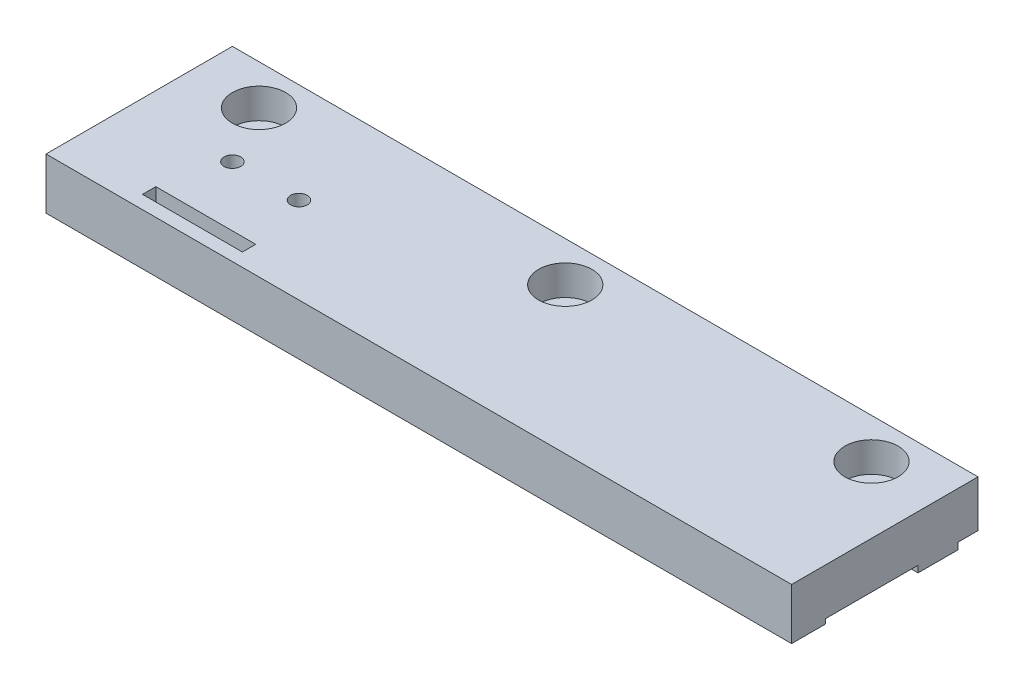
from build123d import *

# Parameters (mm, degrees)
SKETCH_1_W          = 112
SKETCH_1_H          = 8
EXTRUDE_1_DEPTH     = 28
SKETCH_2_OUTSIDE_W  = 53.144
SKETCH_2_OUTSIDE_H  = 33.144
CUT_EXTRUDE_1_DEPTH = 116.723809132
SKETCH_3_R          = 2.25
SKETCH_3_R_2        = 1.25
SKETCH_3_W          = 15
SKETCH_3_H          = 2
CUT_EXTRUDE_3_DEPTH = 28
SKETCH_4_R          = 4
CUT_EXTRUDE_4_DEPTH = 4.5


with BuildPart() as part:
    # Sketch 1 → Extrude 1 (new body)
    with BuildSketch(Plane.XY):
        with Locations((56, 4)):
            Rectangle(SKETCH_1_W, SKETCH_1_H)
    extrude(amount=EXTRUDE_1_DEPTH)

    # Sketch 2 outside → Cut-Extrude 1 (cut, through all)
    with BuildSketch(Plane(origin=(112, 0, 0), x_dir=(0, 0, -1), z_dir=(1, 0, 0))):
        with Locations((-14, 4)):
            Rectangle(SKETCH_2_OUTSIDE_W, SKETCH_2_OUTSIDE_H)
        Polygon((-9, 0), (-9, 1), (-22.9, 1), (-22.9, 0.3), (-28, 0.3), (-28, 8), (0, 8), (0, 1), (-3, 1), (-3, 0), align=None, mode=Mode.SUBTRACT)
    extrude(amount=-CUT_EXTRUDE_1_DEPTH, mode=Mode.SUBTRACT)

    # Sketch 3 → Cut-Extrude 3 (cut)
    with BuildSketch(Plane(origin=(0, 8, 0), x_dir=(1, 0, 0), z_dir=(0, 1, 0))):
        with Locations(Location((10, -6, 0), (0, 0, 270))):
            Circle(SKETCH_3_R)
        with Locations(Location((56, -6, 0), (0, 0, 270))):
            Circle(SKETCH_3_R)
        with Locations(Location((102, -6, 0), (0, 0, 270))):
            Circle(SKETCH_3_R)
        with Locations(Location((15, -15, 0), (0, 0, 270))):
            Circle(SKETCH_3_R_2)
        with Locations(Location((25, -15, 0), (0, 0, 270))):
            Circle(SKETCH_3_R_2)
        with Locations((20, -25)):
            Rectangle(SKETCH_3_W, SKETCH_3_H)
    extrude(amount=-CUT_EXTRUDE_3_DEPTH, mode=Mode.SUBTRACT)

    # Sketch 4 → Cut-Extrude 4 (cut)
    with BuildSketch(Plane(origin=(0, 8, 0), x_dir=(1, 0, 0), z_dir=(0, 1, 0))):
        with Locations(Location((10, -6, 0), (0, 0, 270))):
            Circle(SKETCH_4_R)
        with Locations(Location((56, -6, 0), (0, 0, 270))):
            Circle(SKETCH_4_R)
        with Locations(Location((102, -6, 0), (0, 0, 270))):
            Circle(SKETCH_4_R)
    extrude(amount=-CUT_EXTRUDE_4_DEPTH, mode=Mode.SUBTRACT)


solid = part.part
